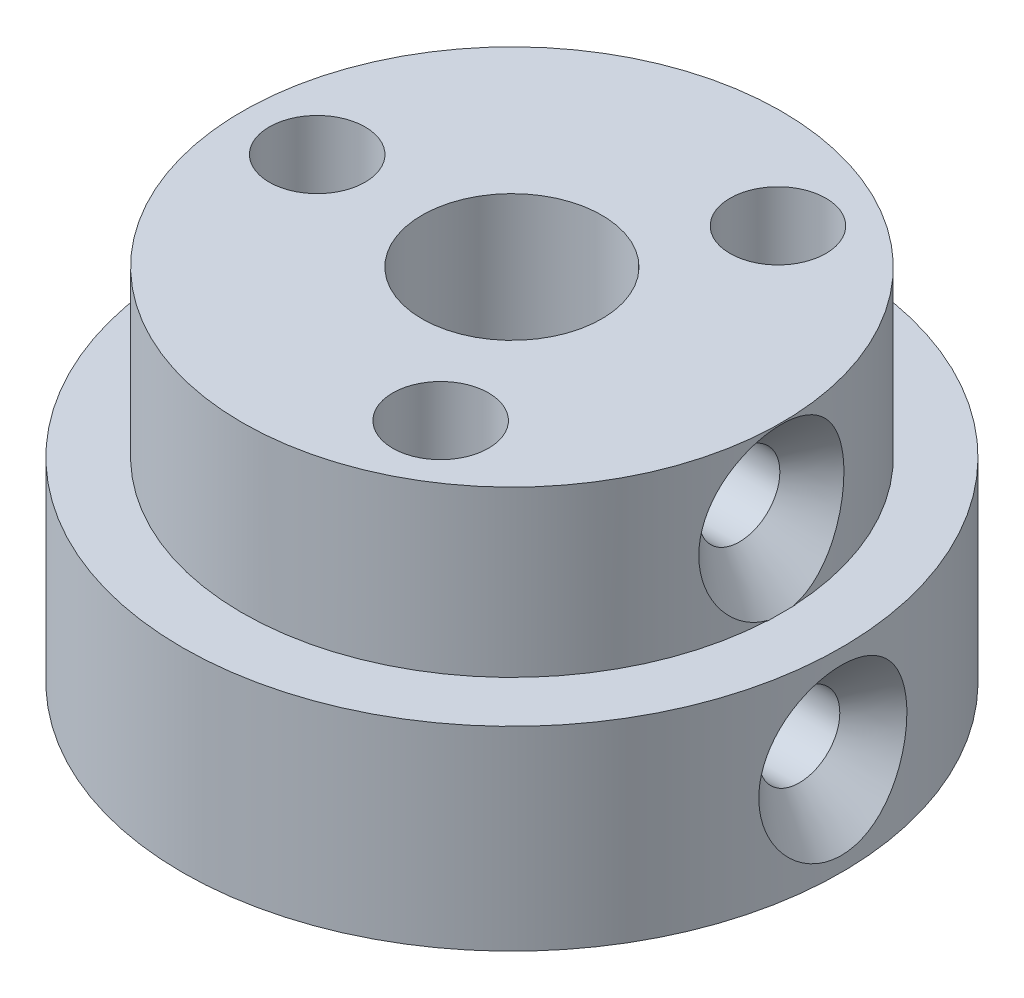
ISO-10303-21;
HEADER;
FILE_DESCRIPTION(('STEP AP214'),'2;1');
FILE_NAME('part.step','',(''),(''),'','','');
FILE_SCHEMA(('AUTOMOTIVE_DESIGN { 1 0 10303 214 1 1 1 1 }'));
ENDSEC;
DATA;
#1=APPLICATION_CONTEXT('core data for automotive mechanical design processes');
#2=APPLICATION_PROTOCOL_DEFINITION('international standard','automotive_design',2000,#1);
#3=PRODUCT_CONTEXT('',#1,'mechanical');
#4=PRODUCT('Part','Part','',(#3));
#5=PRODUCT_RELATED_PRODUCT_CATEGORY('part','',(#4));
#6=PRODUCT_DEFINITION_FORMATION('','',#4);
#7=PRODUCT_DEFINITION_CONTEXT('part definition',#1,'design');
#8=PRODUCT_DEFINITION('design','',#6,#7);
#9=PRODUCT_DEFINITION_SHAPE('','',#8);
#10=(LENGTH_UNIT() NAMED_UNIT(*) SI_UNIT(.MILLI.,.METRE.));
#11=(NAMED_UNIT(*) PLANE_ANGLE_UNIT() SI_UNIT($,.RADIAN.));
#12=(NAMED_UNIT(*) SI_UNIT($,.STERADIAN.) SOLID_ANGLE_UNIT());
#13=UNCERTAINTY_MEASURE_WITH_UNIT(LENGTH_MEASURE(1.E-05),#10,'distance_accuracy_value','');
#14=(GEOMETRIC_REPRESENTATION_CONTEXT(3) GLOBAL_UNCERTAINTY_ASSIGNED_CONTEXT((#13)) GLOBAL_UNIT_ASSIGNED_CONTEXT((#10,
#11,#12)) REPRESENTATION_CONTEXT('',''));
#15=CARTESIAN_POINT('',(0.,0.,0.));
#16=DIRECTION('',(0.,0.,1.));
#17=DIRECTION('',(1.,0.,0.));
#18=AXIS2_PLACEMENT_3D('',#15,#16,#17);
#19=CARTESIAN_POINT('',(0.,12.,0.));
#20=DIRECTION('',(0.,-1.,0.));
#21=DIRECTION('',(0.,0.,-1.));
#22=AXIS2_PLACEMENT_3D('',#19,#20,#21);
#23=CYLINDRICAL_SURFACE('',#22,3.);
#24=CARTESIAN_POINT('',(2.68065100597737,9.20677806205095,-1.34688907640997));
#25=CARTESIAN_POINT('',(2.68065505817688,9.13540011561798,-1.34688542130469));
#26=CARTESIAN_POINT('',(2.68353859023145,9.06390886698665,-1.34118852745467));
#27=CARTESIAN_POINT('',(2.6946800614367,8.92303948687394,-1.31865434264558));
#28=CARTESIAN_POINT('',(2.70295141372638,8.85366708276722,-1.30178924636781));
#29=CARTESIAN_POINT('',(2.72372535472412,8.71932839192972,-1.25773792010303));
#30=CARTESIAN_POINT('',(2.73620871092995,8.6543436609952,-1.23059853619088));
#31=CARTESIAN_POINT('',(2.76396830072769,8.52986363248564,-1.16691118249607));
#32=CARTESIAN_POINT('',(2.77924419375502,8.47036766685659,-1.13036435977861));
#33=CARTESIAN_POINT('',(2.81210632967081,8.35418719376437,-1.04605637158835));
#34=CARTESIAN_POINT('',(2.82977856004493,8.29794909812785,-0.997713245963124));
#35=CARTESIAN_POINT('',(2.86473223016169,8.19403861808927,-0.892404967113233));
#36=CARTESIAN_POINT('',(2.88201350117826,8.14636987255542,-0.83543616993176));
#37=CARTESIAN_POINT('',(2.91531204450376,8.05853658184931,-0.710858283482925));
#38=CARTESIAN_POINT('',(2.93121660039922,8.01889220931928,-0.642849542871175));
#39=CARTESIAN_POINT('',(2.95888121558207,7.95180187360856,-0.500281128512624));
#40=CARTESIAN_POINT('',(2.97064340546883,7.92434963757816,-0.425724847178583));
#41=CARTESIAN_POINT('',(2.98807813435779,7.88409682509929,-0.276883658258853));
#42=CARTESIAN_POINT('',(2.99407141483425,7.8705215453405,-0.202846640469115));
#43=CARTESIAN_POINT('',(3.00045765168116,7.85588642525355,-0.0533198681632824));
#44=CARTESIAN_POINT('',(3.00085328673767,7.85482059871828,0.0221691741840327));
#45=CARTESIAN_POINT('',(2.99617389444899,7.86486883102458,0.16675317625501));
#46=CARTESIAN_POINT('',(2.99148405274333,7.8751262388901,0.235922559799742));
#47=CARTESIAN_POINT('',(2.97769703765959,7.90603697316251,0.371429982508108));
#48=CARTESIAN_POINT('',(2.96859953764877,7.92669107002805,0.437767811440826));
#49=CARTESIAN_POINT('',(2.946679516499,7.97802489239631,0.566958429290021));
#50=CARTESIAN_POINT('',(2.93380251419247,8.00885213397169,0.629742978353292));
#51=CARTESIAN_POINT('',(2.90554153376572,8.0794958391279,0.74940933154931));
#52=CARTESIAN_POINT('',(2.8901566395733,8.11931558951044,0.806288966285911));
#53=CARTESIAN_POINT('',(2.85692586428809,8.21051156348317,0.917388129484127));
#54=CARTESIAN_POINT('',(2.83898156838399,8.26255855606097,0.971028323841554));
#55=CARTESIAN_POINT('',(2.80352640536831,8.37488244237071,1.06909514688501));
#56=CARTESIAN_POINT('',(2.78601576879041,8.43516360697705,1.11351696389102));
#57=CARTESIAN_POINT('',(2.75262745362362,8.56551946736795,1.19374007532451));
#58=CARTESIAN_POINT('',(2.73685422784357,8.63590652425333,1.22908119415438));
#59=CARTESIAN_POINT('',(2.71002386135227,8.78252649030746,1.28716980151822));
#60=CARTESIAN_POINT('',(2.69896270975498,8.85875436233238,1.30992800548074));
#61=CARTESIAN_POINT('',(2.6838518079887,9.00907430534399,1.34060194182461));
#62=CARTESIAN_POINT('',(2.67935574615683,9.08292689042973,1.34946586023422));
#63=CARTESIAN_POINT('',(2.67660252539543,9.23118564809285,1.35492149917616));
#64=CARTESIAN_POINT('',(2.67834253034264,9.30559155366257,1.35151879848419));
#65=CARTESIAN_POINT('',(2.68739898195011,9.44653816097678,1.33340585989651));
#66=CARTESIAN_POINT('',(2.69425769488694,9.51323154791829,1.31962297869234));
#67=CARTESIAN_POINT('',(2.71215967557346,9.64327785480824,1.28242452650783));
#68=CARTESIAN_POINT('',(2.72320403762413,9.70662989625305,1.25900643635));
#69=CARTESIAN_POINT('',(2.74883534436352,9.83140696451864,1.20204750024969));
#70=CARTESIAN_POINT('',(2.76355964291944,9.89261608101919,1.16809760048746));
#71=CARTESIAN_POINT('',(2.79472864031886,10.0087882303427,1.09142256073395));
#72=CARTESIAN_POINT('',(2.81117415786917,10.0637482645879,1.04869323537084));
#73=CARTESIAN_POINT('',(2.84587623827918,10.1714733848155,0.950757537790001));
#74=CARTESIAN_POINT('',(2.86415252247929,10.2234971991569,0.894739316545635));
#75=CARTESIAN_POINT('',(2.89900875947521,10.3175739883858,0.774383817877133));
#76=CARTESIAN_POINT('',(2.91558844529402,10.3596253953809,0.710045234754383));
#77=CARTESIAN_POINT('',(2.94544111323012,10.4328157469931,0.573828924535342));
#78=CARTESIAN_POINT('',(2.95867951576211,10.4638418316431,0.501882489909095));
#79=CARTESIAN_POINT('',(2.98010169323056,10.5130838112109,0.353031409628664));
#80=CARTESIAN_POINT('',(2.98828903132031,10.5313087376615,0.276130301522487));
#81=CARTESIAN_POINT('',(2.99821529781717,10.5531606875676,0.126117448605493));
#82=CARTESIAN_POINT('',(3.00041288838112,10.557827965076,0.0531868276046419));
#83=CARTESIAN_POINT('',(2.99945879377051,10.5553327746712,-0.0924271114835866));
#84=CARTESIAN_POINT('',(2.99630834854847,10.548173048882,-0.165110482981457));
#85=CARTESIAN_POINT('',(2.98527352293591,10.5229666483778,-0.304664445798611));
#86=CARTESIAN_POINT('',(2.97761507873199,10.5054393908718,-0.371648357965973));
#87=CARTESIAN_POINT('',(2.95848714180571,10.460611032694,-0.501673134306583));
#88=CARTESIAN_POINT('',(2.94701699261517,10.4333082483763,-0.564713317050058));
#89=CARTESIAN_POINT('',(2.92069666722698,10.3683332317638,-0.688260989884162));
#90=CARTESIAN_POINT('',(2.90571574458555,10.330243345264,-0.748520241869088));
#91=CARTESIAN_POINT('',(2.87407962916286,10.2453444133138,-0.862058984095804));
#92=CARTESIAN_POINT('',(2.85742371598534,10.1985316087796,-0.915335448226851));
#93=CARTESIAN_POINT('',(2.82259407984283,10.093077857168,-1.01790422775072));
#94=CARTESIAN_POINT('',(2.80440660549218,10.0337862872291,-1.06652522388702));
#95=CARTESIAN_POINT('',(2.76986078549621,9.90741295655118,-1.15328176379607));
#96=CARTESIAN_POINT('',(2.7535036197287,9.84032622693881,-1.1914105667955));
#97=CARTESIAN_POINT('',(2.72460083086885,9.69949242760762,-1.2561130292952));
#98=CARTESIAN_POINT('',(2.71207886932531,9.62570751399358,-1.28261537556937));
#99=CARTESIAN_POINT('',(2.692884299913,9.47407510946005,-1.32245142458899));
#100=CARTESIAN_POINT('',(2.68619206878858,9.39624218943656,-1.33582932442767));
#101=CARTESIAN_POINT('',(2.68218265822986,9.29938067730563,-1.34383611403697));
#102=CARTESIAN_POINT('',(2.6816095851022,9.28088573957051,-1.34497979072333));
#103=CARTESIAN_POINT('',(2.68084322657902,9.24385577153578,-1.34650675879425));
#104=CARTESIAN_POINT('',(2.68064995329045,9.22532073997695,-1.34689002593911));
#105=CARTESIAN_POINT('',(2.68065100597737,9.20677806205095,-1.34688907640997));
#106=B_SPLINE_CURVE_WITH_KNOTS('',3,(#24,#25,#26,#27,#28,#29,#30,#31,#32,#33,#34,#35,#36,#37,
#38,#39,#40,#41,#42,#43,#44,#45,#46,#47,#48,#49,#50,#51,#52,#53,#54,#55,#56,#57,#58,#59,#60,#61,
#62,#63,#64,#65,#66,#67,#68,#69,#70,#71,#72,#73,#74,#75,#76,#77,#78,#79,#80,#81,#82,#83,#84,#85,
#86,#87,#88,#89,#90,#91,#92,#93,#94,#95,#96,#97,#98,#99,#100,#101,#102,#103,#104,#105),
.UNSPECIFIED.,.T.,.F.,(4,2,2,2,2,2,2,2,2,2,2,2,2,2,2,2,2,2,2,2,2,2,2,2,2,2,2,2,2,2,2,2,2,2,2,2,
2,2,2,2,4),(0.,0.214055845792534,0.428646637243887,0.642270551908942,0.855868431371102,
1.08359761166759,1.31142326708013,1.55111519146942,1.7906836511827,2.01599531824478,
2.24119916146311,2.45046498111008,2.65974631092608,2.87220645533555,3.08474438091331,
3.31433040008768,3.54403595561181,3.78375440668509,4.02326840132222,4.24558900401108,
4.46780850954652,4.67223214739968,4.87670926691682,5.09041213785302,5.30421712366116,
5.53894745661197,5.77371467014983,6.01082017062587,6.24775821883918,6.46596276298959,
6.68411672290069,6.8921700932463,7.10025931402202,7.3178791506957,7.53559298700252,
7.77092535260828,8.00640855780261,8.24331661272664,8.47942410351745,8.53503010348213,
8.59063787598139),.UNSPECIFIED.);
#107=CARTESIAN_POINT('',(2.68065100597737,9.20677806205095,-1.34688907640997));
#108=VERTEX_POINT('',#107);
#109=EDGE_CURVE('E112',#108,#108,#106,.T.);
#110=ORIENTED_EDGE('',*,*,#109,.F.);
#111=EDGE_LOOP('',(#110));
#112=FACE_BOUND('',#111,.T.);
#113=CARTESIAN_POINT('',(2.68016418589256,3.24291067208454,-1.34785753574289));
#114=CARTESIAN_POINT('',(2.68016823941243,3.17153272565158,-1.34785388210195));
#115=CARTESIAN_POINT('',(2.68305382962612,3.10004147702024,-1.34215803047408));
#116=CARTESIAN_POINT('',(2.69420344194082,2.95917209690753,-1.31962787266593));
#117=CARTESIAN_POINT('',(2.70248088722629,2.88979969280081,-1.30276576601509));
#118=CARTESIAN_POINT('',(2.72327074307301,2.75546100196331,-1.25872194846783));
#119=CARTESIAN_POINT('',(2.73576390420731,2.69047627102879,-1.23158707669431));
#120=CARTESIAN_POINT('',(2.76354650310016,2.56599624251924,-1.16790975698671));
#121=CARTESIAN_POINT('',(2.77883559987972,2.50650027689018,-1.13136845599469));
#122=CARTESIAN_POINT('',(2.8117281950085,2.39031980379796,-1.04707234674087));
#123=CARTESIAN_POINT('',(2.82941789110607,2.33408170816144,-0.998735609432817));
#124=CARTESIAN_POINT('',(2.86440960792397,2.23017122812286,-0.8934399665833));
#125=CARTESIAN_POINT('',(2.88171146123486,2.18250248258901,-0.836477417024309));
#126=CARTESIAN_POINT('',(2.91505501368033,2.0946691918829,-0.711911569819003));
#127=CARTESIAN_POINT('',(2.930984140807,2.05502481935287,-0.643908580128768));
#128=CARTESIAN_POINT('',(2.95870026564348,1.98793448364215,-0.501350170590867));
#129=CARTESIAN_POINT('',(2.97048939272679,1.96048224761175,-0.426798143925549));
#130=CARTESIAN_POINT('',(2.98797789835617,1.92022943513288,-0.277963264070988));
#131=CARTESIAN_POINT('',(2.99399792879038,1.90665415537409,-0.203928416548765));
#132=CARTESIAN_POINT('',(3.00043819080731,1.89201903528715,-0.0544039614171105));
#133=CARTESIAN_POINT('',(3.00086110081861,1.89095320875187,0.0210849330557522));
#134=CARTESIAN_POINT('',(2.99623394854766,1.90100144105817,0.165670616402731));
#135=CARTESIAN_POINT('',(2.99156909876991,1.91125884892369,0.234841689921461));
#136=CARTESIAN_POINT('',(2.9778310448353,1.9421695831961,0.370354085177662));
#137=CARTESIAN_POINT('',(2.96875751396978,1.96282368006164,0.436695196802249));
#138=CARTESIAN_POINT('',(2.94688417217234,2.0141575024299,0.565893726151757));
#139=CARTESIAN_POINT('',(2.93402985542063,2.04498474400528,0.628682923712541));
#140=CARTESIAN_POINT('',(2.90581211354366,2.11562844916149,0.748359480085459));
#141=CARTESIAN_POINT('',(2.89044777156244,2.15544819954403,0.805244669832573));
#142=CARTESIAN_POINT('',(2.85725713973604,2.24664417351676,0.916355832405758));
#143=CARTESIAN_POINT('',(2.83933222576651,2.29869116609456,0.970002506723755));
#144=CARTESIAN_POINT('',(2.80391249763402,2.4110150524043,1.06808213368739));
#145=CARTESIAN_POINT('',(2.78641791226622,2.47129621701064,1.11251027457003));
#146=CARTESIAN_POINT('',(2.75305858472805,2.60165207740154,1.19274544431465));
#147=CARTESIAN_POINT('',(2.73729812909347,2.67203913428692,1.22809225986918));
#148=CARTESIAN_POINT('',(2.7104887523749,2.81865910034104,1.28619055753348));
#149=CARTESIAN_POINT('',(2.69943582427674,2.89488697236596,1.30895275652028));
#150=CARTESIAN_POINT('',(2.68433600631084,3.04520691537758,1.33963215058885));
#151=CARTESIAN_POINT('',(2.67984314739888,3.11905950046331,1.34849769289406));
#152=CARTESIAN_POINT('',(2.6770918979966,3.26731825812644,1.35395432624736));
#153=CARTESIAN_POINT('',(2.67883067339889,3.34172416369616,1.3505509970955));
#154=CARTESIAN_POINT('',(2.68788058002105,3.48267077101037,1.3324347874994));
#155=CARTESIAN_POINT('',(2.69473431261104,3.54936415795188,1.31864942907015));
#156=CARTESIAN_POINT('',(2.71262285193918,3.67941046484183,1.28144451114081));
#157=CARTESIAN_POINT('',(2.72365875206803,3.74276250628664,1.25802243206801));
#158=CARTESIAN_POINT('',(2.749269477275,3.86753957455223,1.20105423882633));
#159=CARTESIAN_POINT('',(2.76398150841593,3.92874869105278,1.16709902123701));
#160=CARTESIAN_POINT('',(2.79512280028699,4.04492084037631,1.09041272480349));
#161=CARTESIAN_POINT('',(2.81155287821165,4.09988087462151,1.04767746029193));
#162=CARTESIAN_POINT('',(2.84621957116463,4.20760599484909,0.949729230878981));
#163=CARTESIAN_POINT('',(2.86447561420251,4.25962980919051,0.893704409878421));
#164=CARTESIAN_POINT('',(2.8992883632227,4.35370659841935,0.773336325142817));
#165=CARTESIAN_POINT('',(2.91584480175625,4.39575800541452,0.708991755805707));
#166=CARTESIAN_POINT('',(2.94564825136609,4.46894835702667,0.572764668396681));
#167=CARTESIAN_POINT('',(2.95886065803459,4.49997444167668,0.500813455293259));
#168=CARTESIAN_POINT('',(2.98022905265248,4.5492164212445,0.351954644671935));
#169=CARTESIAN_POINT('',(2.98838860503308,4.56744134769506,0.275050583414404));
#170=CARTESIAN_POINT('',(2.99826066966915,4.58929329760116,0.125034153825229));
#171=CARTESIAN_POINT('',(3.00043190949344,4.59396057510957,0.0521027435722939));
#172=CARTESIAN_POINT('',(2.9994252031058,4.59146538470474,-0.0935108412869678));
#173=CARTESIAN_POINT('',(2.99624849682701,4.58430565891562,-0.166193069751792));
#174=CARTESIAN_POINT('',(2.98516324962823,4.55909925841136,-0.305743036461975));
#175=CARTESIAN_POINT('',(2.97748060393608,4.5415720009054,-0.372724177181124));
#176=CARTESIAN_POINT('',(2.95830568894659,4.49674364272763,-0.502742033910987));
#177=CARTESIAN_POINT('',(2.94681276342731,4.46944085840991,-0.565778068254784));
#178=CARTESIAN_POINT('',(2.92044780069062,4.40446584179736,-0.689316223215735));
#179=CARTESIAN_POINT('',(2.90544510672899,4.3663759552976,-0.749570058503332));
#180=CARTESIAN_POINT('',(2.87376797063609,4.2814770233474,-0.863097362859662));
#181=CARTESIAN_POINT('',(2.85709280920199,4.23466421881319,-0.916367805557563));
#182=CARTESIAN_POINT('',(2.82222611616,4.12921046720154,-1.01892399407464));
#183=CARTESIAN_POINT('',(2.80402107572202,4.0699188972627,-1.0675384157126));
#184=CARTESIAN_POINT('',(2.76944391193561,3.94354556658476,-1.15428246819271));
#185=CARTESIAN_POINT('',(2.75307297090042,3.8764588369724,-1.19240535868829));
#186=CARTESIAN_POINT('',(2.72414680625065,3.73562503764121,-1.25709737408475));
#187=CARTESIAN_POINT('',(2.71161526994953,3.66184012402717,-1.28359519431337));
#188=CARTESIAN_POINT('',(2.6924063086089,3.51020771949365,-1.32342430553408));
#189=CARTESIAN_POINT('',(2.68570924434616,3.43237479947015,-1.33679978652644));
#190=CARTESIAN_POINT('',(2.68169694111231,3.33551328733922,-1.34480512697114));
#191=CARTESIAN_POINT('',(2.6811234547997,3.3170183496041,-1.34594859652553));
#192=CARTESIAN_POINT('',(2.68035654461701,3.27998838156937,-1.34747528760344));
#193=CARTESIAN_POINT('',(2.68016313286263,3.26145335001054,-1.34785848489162));
#194=CARTESIAN_POINT('',(2.68016418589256,3.24291067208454,-1.34785753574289));
#195=B_SPLINE_CURVE_WITH_KNOTS('',3,(#113,#114,#115,#116,#117,#118,#119,#120,#121,#122,#123,
#124,#125,#126,#127,#128,#129,#130,#131,#132,#133,#134,#135,#136,#137,#138,#139,#140,#141,#142,
#143,#144,#145,#146,#147,#148,#149,#150,#151,#152,#153,#154,#155,#156,#157,#158,#159,#160,#161,
#162,#163,#164,#165,#166,#167,#168,#169,#170,#171,#172,#173,#174,#175,#176,#177,#178,#179,#180,
#181,#182,#183,#184,#185,#186,#187,#188,#189,#190,#191,#192,#193,#194),.UNSPECIFIED.,.T.,.F.,(4,
2,2,2,2,2,2,2,2,2,2,2,2,2,2,2,2,2,2,2,2,2,2,2,2,2,2,2,2,2,2,2,2,2,2,2,2,2,2,2,4),(0.,
0.214055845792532,0.428646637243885,0.642270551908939,0.855868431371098,1.08359761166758,
1.31142326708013,1.55111519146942,1.7906836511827,2.01599531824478,2.2411991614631,
2.45046498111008,2.65974631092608,2.87220645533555,3.08474438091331,3.31433040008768,
3.5440359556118,3.78375440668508,4.02326840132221,4.24558900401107,4.46780850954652,
4.67223214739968,4.87670926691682,5.09041213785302,5.30421712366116,5.53894745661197,
5.77371467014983,6.01082017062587,6.24775821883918,6.46596276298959,6.68411672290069,
6.8921700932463,7.10025931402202,7.3178791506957,7.53559298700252,7.77092535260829,
8.00640855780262,8.24331661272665,8.47942410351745,8.53503010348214,8.5906378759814),.UNSPECIFIED.);
#196=CARTESIAN_POINT('',(2.68016418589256,3.24291067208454,-1.34785753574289));
#197=VERTEX_POINT('',#196);
#198=EDGE_CURVE('E175',#197,#197,#195,.T.);
#199=ORIENTED_EDGE('',*,*,#198,.F.);
#200=EDGE_LOOP('',(#199));
#201=FACE_BOUND('',#200,.T.);
#202=CARTESIAN_POINT('',(0.,12.,0.));
#203=DIRECTION('',(0.,1.,0.));
#204=DIRECTION('',(0.,0.,1.));
#205=AXIS2_PLACEMENT_3D('',#202,#203,#204);
#206=CIRCLE('',#205,3.);
#207=CARTESIAN_POINT('',(0.,12.,3.));
#208=VERTEX_POINT('',#207);
#209=EDGE_CURVE('E179',#208,#208,#206,.T.);
#210=ORIENTED_EDGE('',*,*,#209,.T.);
#211=EDGE_LOOP('',(#210));
#212=FACE_BOUND('',#211,.T.);
#213=CARTESIAN_POINT('',(0.,0.,0.));
#214=DIRECTION('',(0.,1.,0.));
#215=DIRECTION('',(0.,0.,1.));
#216=AXIS2_PLACEMENT_3D('',#213,#214,#215);
#217=CIRCLE('',#216,3.);
#218=CARTESIAN_POINT('',(0.,0.,3.));
#219=VERTEX_POINT('',#218);
#220=EDGE_CURVE('E182',#219,#219,#217,.T.);
#221=ORIENTED_EDGE('',*,*,#220,.F.);
#222=EDGE_LOOP('',(#221));
#223=FACE_BOUND('',#222,.T.);
#224=ADVANCED_FACE('F38',(#112,#201,#212,#223),#23,.F.);
#225=CARTESIAN_POINT('',(0.,12.,0.));
#226=DIRECTION('',(0.,-1.,0.));
#227=DIRECTION('',(0.,0.,-1.));
#228=AXIS2_PLACEMENT_3D('',#225,#226,#227);
#229=CYLINDRICAL_SURFACE('',#228,9.);
#230=CARTESIAN_POINT('',(0.,6.5,0.));
#231=DIRECTION('',(0.,1.,0.));
#232=DIRECTION('',(0.,0.,1.));
#233=AXIS2_PLACEMENT_3D('',#230,#231,#232);
#234=CIRCLE('',#233,9.);
#235=CARTESIAN_POINT('',(8.99044255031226,6.5,-0.414659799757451));
#236=VERTEX_POINT('',#235);
#237=CARTESIAN_POINT('',(8.98945560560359,6.5,0.435531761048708));
#238=VERTEX_POINT('',#237);
#239=EDGE_CURVE('E189',#236,#238,#234,.T.);
#240=ORIENTED_EDGE('',*,*,#239,.T.);
#241=CARTESIAN_POINT('',(8.81845303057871,7.38623172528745,-1.79857899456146));
#242=CARTESIAN_POINT('',(8.83426355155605,7.28680325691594,-1.72105270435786));
#243=CARTESIAN_POINT('',(8.85042986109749,7.19287396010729,-1.63658913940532));
#244=CARTESIAN_POINT('',(8.88215373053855,7.0184075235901,-1.45460467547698));
#245=CARTESIAN_POINT('',(8.89771120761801,6.93787220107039,-1.35708200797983));
#246=CARTESIAN_POINT('',(8.92896946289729,6.78210420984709,-1.13484283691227));
#247=CARTESIAN_POINT('',(8.94434508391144,6.70945688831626,-1.00824002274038));
#248=CARTESIAN_POINT('',(8.9702675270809,6.589808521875,-0.742946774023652));
#249=CARTESIAN_POINT('',(8.98081806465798,6.54278773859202,-0.604265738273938));
#250=CARTESIAN_POINT('',(8.99447585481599,6.48206264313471,-0.338682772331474));
#251=CARTESIAN_POINT('',(8.99838049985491,6.46478562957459,-0.212635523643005));
#252=CARTESIAN_POINT('',(9.00079668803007,6.45319319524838,0.0405291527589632));
#253=CARTESIAN_POINT('',(8.99931145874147,6.45886403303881,0.167645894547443));
#254=CARTESIAN_POINT('',(8.9914844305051,6.49132350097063,0.407999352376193));
#255=CARTESIAN_POINT('',(8.98556258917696,6.51629162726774,0.521502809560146));
#256=CARTESIAN_POINT('',(8.96997767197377,6.58383763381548,0.742844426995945));
#257=CARTESIAN_POINT('',(8.96031416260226,6.62641755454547,0.85068192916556));
#258=CARTESIAN_POINT('',(8.937738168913,6.7292569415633,1.0623628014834));
#259=CARTESIAN_POINT('',(8.92471485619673,6.79013433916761,1.16589222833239));
#260=CARTESIAN_POINT('',(8.89681944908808,6.92649419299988,1.36252922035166));
#261=CARTESIAN_POINT('',(8.8819466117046,7.00198252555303,1.45563256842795));
#262=CARTESIAN_POINT('',(8.84972408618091,7.17516329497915,1.6408125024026));
#263=CARTESIAN_POINT('',(8.83229286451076,7.2744386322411,1.731393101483));
#264=CARTESIAN_POINT('',(8.79824430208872,7.48542359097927,1.89685154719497));
#265=CARTESIAN_POINT('',(8.78162739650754,7.59713975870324,1.97172106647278));
#266=CARTESIAN_POINT('',(8.74862117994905,7.8454356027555,2.11367593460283));
#267=CARTESIAN_POINT('',(8.73254167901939,7.98336008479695,2.17848765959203));
#268=CARTESIAN_POINT('',(8.70492974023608,8.26790583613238,2.28632930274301));
#269=CARTESIAN_POINT('',(8.69339889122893,8.41453012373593,2.32935161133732));
#270=CARTESIAN_POINT('',(8.67542867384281,8.7241737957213,2.39545941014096));
#271=CARTESIAN_POINT('',(8.66943897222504,8.88759560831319,2.416796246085));
#272=CARTESIAN_POINT('',(8.6648289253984,9.21586162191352,2.4332714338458));
#273=CARTESIAN_POINT('',(8.6662095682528,9.380706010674,2.42840627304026));
#274=CARTESIAN_POINT('',(8.67626929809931,9.71036218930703,2.39221888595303));
#275=CARTESIAN_POINT('',(8.6850835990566,9.87511639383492,2.36040645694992));
#276=CARTESIAN_POINT('',(8.70910298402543,10.196734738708,2.27017375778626));
#277=CARTESIAN_POINT('',(8.7243093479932,10.3535972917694,2.21174815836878));
#278=CARTESIAN_POINT('',(8.75910439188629,10.6536070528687,2.06963531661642));
#279=CARTESIAN_POINT('',(8.77866208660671,10.7968414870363,1.98612529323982));
#280=CARTESIAN_POINT('',(8.81975429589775,11.0658953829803,1.79484559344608));
#281=CARTESIAN_POINT('',(8.84128865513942,11.191716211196,1.68707782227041));
#282=CARTESIAN_POINT('',(8.88213446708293,11.4136002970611,1.45622090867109));
#283=CARTESIAN_POINT('',(8.9015019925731,11.510986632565,1.33442099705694));
#284=CARTESIAN_POINT('',(8.9366794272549,11.6802190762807,1.07374925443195));
#285=CARTESIAN_POINT('',(8.95249433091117,11.7521011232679,0.934901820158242));
#286=CARTESIAN_POINT('',(8.97630905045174,11.8576199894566,0.664598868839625));
#287=CARTESIAN_POINT('',(8.98508195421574,11.8951432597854,0.534730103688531));
#288=CARTESIAN_POINT('',(8.99691960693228,11.9450134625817,0.270018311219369));
#289=CARTESIAN_POINT('',(8.99998990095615,11.9573848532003,0.135180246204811));
#290=CARTESIAN_POINT('',(9.00000883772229,11.9562012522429,-0.117734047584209));
#291=CARTESIAN_POINT('',(8.99766287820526,11.9456432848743,-0.235835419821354));
#292=CARTESIAN_POINT('',(8.98855277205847,11.9051516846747,-0.468470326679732));
#293=CARTESIAN_POINT('',(8.98178883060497,11.875218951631,-0.583004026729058));
#294=CARTESIAN_POINT('',(8.96464379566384,11.7978188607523,-0.804640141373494));
#295=CARTESIAN_POINT('',(8.95429086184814,11.7504878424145,-0.91179284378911));
#296=CARTESIAN_POINT('',(8.93095912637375,11.6403065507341,-1.11745156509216));
#297=CARTESIAN_POINT('',(8.91797955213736,11.5774517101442,-1.21595502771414));
#298=CARTESIAN_POINT('',(8.88915559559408,11.4315613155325,-1.4119768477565));
#299=CARTESIAN_POINT('',(8.87315499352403,11.347148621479,-1.50844462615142));
#300=CARTESIAN_POINT('',(8.84079609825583,11.1650278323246,-1.68779327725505));
#301=CARTESIAN_POINT('',(8.82443762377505,11.0673128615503,-1.77066707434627));
#302=CARTESIAN_POINT('',(8.79057386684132,10.8471343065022,-1.93223500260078));
#303=CARTESIAN_POINT('',(8.77321396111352,10.7231115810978,-2.00883777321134));
#304=CARTESIAN_POINT('',(8.74152358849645,10.4646100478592,-2.14254375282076));
#305=CARTESIAN_POINT('',(8.72719448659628,10.3301265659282,-2.19963818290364));
#306=CARTESIAN_POINT('',(8.70173662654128,10.0400145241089,-2.29840464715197));
#307=CARTESIAN_POINT('',(8.69107334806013,9.88361834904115,-2.33795396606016));
#308=CARTESIAN_POINT('',(8.6763366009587,9.5662642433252,-2.39206418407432));
#309=CARTESIAN_POINT('',(8.67226411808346,9.40530563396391,-2.40662134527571));
#310=CARTESIAN_POINT('',(8.6711647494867,9.0772707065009,-2.41058490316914));
#311=CARTESIAN_POINT('',(8.67439512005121,8.91018152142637,-2.39907294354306));
#312=CARTESIAN_POINT('',(8.68804234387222,8.58029966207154,-2.34916518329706));
#313=CARTESIAN_POINT('',(8.69846195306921,8.41750866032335,-2.31075907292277));
#314=CARTESIAN_POINT('',(8.72514639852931,8.1015458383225,-2.20785488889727));
#315=CARTESIAN_POINT('',(8.7413899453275,7.94834133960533,-2.1434517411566));
#316=CARTESIAN_POINT('',(8.77770652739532,7.65570940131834,-1.98949622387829));
#317=CARTESIAN_POINT('',(8.79777550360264,7.51626759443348,-1.89997046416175));
#318=CARTESIAN_POINT('',(8.81845303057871,7.38623172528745,-1.79857899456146));
#319=B_SPLINE_CURVE_WITH_KNOTS('',3,(#241,#242,#243,#244,#245,#246,#247,#248,#249,#250,#251,
#252,#253,#254,#255,#256,#257,#258,#259,#260,#261,#262,#263,#264,#265,#266,#267,#268,#269,#270,
#271,#272,#273,#274,#275,#276,#277,#278,#279,#280,#281,#282,#283,#284,#285,#286,#287,#288,#289,
#290,#291,#292,#293,#294,#295,#296,#297,#298,#299,#300,#301,#302,#303,#304,#305,#306,#307,#308,
#309,#310,#311,#312,#313,#314,#315,#316,#317,#318),.UNSPECIFIED.,.T.,.F.,(4,2,2,2,2,2,2,2,2,2,2,
2,2,2,2,2,2,2,2,2,2,2,2,2,2,2,2,2,2,2,2,2,2,2,2,2,2,2,4),(0.,0.380806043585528,
0.761663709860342,1.19936381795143,1.63672631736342,2.01647788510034,2.3960020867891,
2.74353284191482,3.09110387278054,3.45206563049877,3.81317286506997,4.21810605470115,
4.62325333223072,5.08101601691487,5.53893845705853,6.03140262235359,6.52393280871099,
7.02562001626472,7.52740773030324,8.02573056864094,8.52401428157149,8.99271947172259,
9.46076154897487,9.86478247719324,10.2684103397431,10.6224758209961,10.9765248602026,
11.3278566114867,11.6792918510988,12.065306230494,12.4515208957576,12.8901173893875,
13.3289109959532,13.811739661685,14.2946405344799,14.794816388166,15.2951840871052,
15.7937410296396,16.2917718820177),.UNSPECIFIED.);
#320=EDGE_CURVE('E54',#238,#236,#319,.T.);
#321=ORIENTED_EDGE('',*,*,#320,.T.);
#322=EDGE_LOOP('',(#240,#321));
#323=FACE_BOUND('',#322,.T.);
#324=CARTESIAN_POINT('',(0.,12.,0.));
#325=DIRECTION('',(0.,1.,0.));
#326=DIRECTION('',(0.,0.,1.));
#327=AXIS2_PLACEMENT_3D('',#324,#325,#326);
#328=CIRCLE('',#327,9.);
#329=CARTESIAN_POINT('',(0.,12.,9.));
#330=VERTEX_POINT('',#329);
#331=EDGE_CURVE('E186',#330,#330,#328,.T.);
#332=ORIENTED_EDGE('',*,*,#331,.F.);
#333=EDGE_LOOP('',(#332));
#334=FACE_BOUND('',#333,.T.);
#335=ADVANCED_FACE('F164',(#323,#334),#229,.T.);
#336=CARTESIAN_POINT('',(0.,12.,0.));
#337=DIRECTION('',(0.,1.,0.));
#338=DIRECTION('',(0.,0.,1.));
#339=AXIS2_PLACEMENT_3D('',#336,#337,#338);
#340=PLANE('',#339);
#341=CARTESIAN_POINT('',(3.25000000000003,12.,-5.62916512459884));
#342=DIRECTION('',(0.,1.,0.));
#343=DIRECTION('',(0.,0.,1.));
#344=AXIS2_PLACEMENT_3D('',#341,#342,#343);
#345=CIRCLE('',#344,1.6);
#346=CARTESIAN_POINT('',(3.25000000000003,12.,-4.02916512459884));
#347=VERTEX_POINT('',#346);
#348=EDGE_CURVE('E41',#347,#347,#345,.T.);
#349=ORIENTED_EDGE('',*,*,#348,.F.);
#350=EDGE_LOOP('',(#349));
#351=FACE_BOUND('',#350,.T.);
#352=CARTESIAN_POINT('',(3.25000000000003,12.,5.62916512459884));
#353=DIRECTION('',(0.,1.,0.));
#354=DIRECTION('',(0.,0.,1.));
#355=AXIS2_PLACEMENT_3D('',#352,#353,#354);
#356=CIRCLE('',#355,1.6);
#357=CARTESIAN_POINT('',(3.25000000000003,12.,7.22916512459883));
#358=VERTEX_POINT('',#357);
#359=EDGE_CURVE('E91',#358,#358,#356,.T.);
#360=ORIENTED_EDGE('',*,*,#359,.F.);
#361=EDGE_LOOP('',(#360));
#362=FACE_BOUND('',#361,.T.);
#363=CARTESIAN_POINT('',(-6.5,12.,0.));
#364=DIRECTION('',(0.,1.,0.));
#365=DIRECTION('',(0.,0.,1.));
#366=AXIS2_PLACEMENT_3D('',#363,#364,#365);
#367=CIRCLE('',#366,1.6);
#368=CARTESIAN_POINT('',(-6.5,12.,1.6));
#369=VERTEX_POINT('',#368);
#370=EDGE_CURVE('E76',#369,#369,#367,.T.);
#371=ORIENTED_EDGE('',*,*,#370,.F.);
#372=EDGE_LOOP('',(#371));
#373=FACE_BOUND('',#372,.T.);
#374=ORIENTED_EDGE('',*,*,#209,.F.);
#375=EDGE_LOOP('',(#374));
#376=FACE_BOUND('',#375,.T.);
#377=ORIENTED_EDGE('',*,*,#331,.T.);
#378=EDGE_LOOP('',(#377));
#379=FACE_BOUND('',#378,.T.);
#380=ADVANCED_FACE('F169',(#351,#362,#373,#376,#379),#340,.T.);
#381=CARTESIAN_POINT('',(0.,0.,0.));
#382=DIRECTION('',(0.,1.,0.));
#383=DIRECTION('',(0.,0.,1.));
#384=AXIS2_PLACEMENT_3D('',#381,#382,#383);
#385=PLANE('',#384);
#386=CARTESIAN_POINT('',(3.25000000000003,0.,-5.62916512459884));
#387=DIRECTION('',(0.,-1.,0.));
#388=DIRECTION('',(0.,0.,-1.));
#389=AXIS2_PLACEMENT_3D('',#386,#387,#388);
#390=CIRCLE('',#389,3.15);
#391=CARTESIAN_POINT('',(3.25000000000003,0.,-8.77916512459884));
#392=VERTEX_POINT('',#391);
#393=EDGE_CURVE('E236',#392,#392,#390,.T.);
#394=ORIENTED_EDGE('',*,*,#393,.F.);
#395=EDGE_LOOP('',(#394));
#396=FACE_BOUND('',#395,.T.);
#397=CARTESIAN_POINT('',(3.25000000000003,0.,5.62916512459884));
#398=DIRECTION('',(0.,-1.,0.));
#399=DIRECTION('',(0.,0.,-1.));
#400=AXIS2_PLACEMENT_3D('',#397,#398,#399);
#401=CIRCLE('',#400,3.15);
#402=CARTESIAN_POINT('',(3.25000000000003,0.,2.47916512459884));
#403=VERTEX_POINT('',#402);
#404=EDGE_CURVE('E100',#403,#403,#401,.T.);
#405=ORIENTED_EDGE('',*,*,#404,.F.);
#406=EDGE_LOOP('',(#405));
#407=FACE_BOUND('',#406,.T.);
#408=CARTESIAN_POINT('',(-6.5,0.,0.));
#409=DIRECTION('',(0.,-1.,0.));
#410=DIRECTION('',(0.,0.,-1.));
#411=AXIS2_PLACEMENT_3D('',#408,#409,#410);
#412=CIRCLE('',#411,3.15);
#413=CARTESIAN_POINT('',(-6.5,0.,-3.15));
#414=VERTEX_POINT('',#413);
#415=EDGE_CURVE('E93',#414,#414,#412,.T.);
#416=ORIENTED_EDGE('',*,*,#415,.F.);
#417=EDGE_LOOP('',(#416));
#418=FACE_BOUND('',#417,.T.);
#419=ORIENTED_EDGE('',*,*,#220,.T.);
#420=EDGE_LOOP('',(#419));
#421=FACE_BOUND('',#420,.T.);
#422=CARTESIAN_POINT('',(0.,0.,0.));
#423=DIRECTION('',(0.,1.,0.));
#424=DIRECTION('',(0.,0.,1.));
#425=AXIS2_PLACEMENT_3D('',#422,#423,#424);
#426=CIRCLE('',#425,11.);
#427=CARTESIAN_POINT('',(0.,0.,11.));
#428=VERTEX_POINT('',#427);
#429=EDGE_CURVE('E215',#428,#428,#426,.T.);
#430=ORIENTED_EDGE('',*,*,#429,.F.);
#431=EDGE_LOOP('',(#430));
#432=FACE_BOUND('',#431,.T.);
#433=ADVANCED_FACE('F222',(#396,#407,#418,#421,#432),#385,.F.);
#434=CARTESIAN_POINT('',(0.,6.5,0.));
#435=DIRECTION('',(0.,-1.,0.));
#436=DIRECTION('',(0.,0.,-1.));
#437=AXIS2_PLACEMENT_3D('',#434,#435,#436);
#438=CYLINDRICAL_SURFACE('',#437,11.);
#439=CARTESIAN_POINT('',(10.8496592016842,1.38973389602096,-1.81242809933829));
#440=CARTESIAN_POINT('',(10.8632241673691,1.29082745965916,-1.73121897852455));
#441=CARTESIAN_POINT('',(10.8770335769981,1.19776412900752,-1.64295679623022));
#442=CARTESIAN_POINT('',(10.9039776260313,1.02576083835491,-1.45342027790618));
#443=CARTESIAN_POINT('',(10.9171121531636,0.94682322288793,-1.35214378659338));
#444=CARTESIAN_POINT('',(10.9431136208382,0.796273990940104,-1.12388654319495));
#445=CARTESIAN_POINT('',(10.9557104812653,0.727049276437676,-0.995279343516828));
#446=CARTESIAN_POINT('',(10.9767690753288,0.613896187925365,-0.727027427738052));
#447=CARTESIAN_POINT('',(10.9852328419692,0.569955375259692,-0.587388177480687));
#448=CARTESIAN_POINT('',(10.9961582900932,0.513357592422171,-0.317418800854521));
#449=CARTESIAN_POINT('',(10.9991687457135,0.497838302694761,-0.187708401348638));
#450=CARTESIAN_POINT('',(11.0005290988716,0.489990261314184,0.0724054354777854));
#451=CARTESIAN_POINT('',(10.9988812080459,0.49765050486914,0.202808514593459));
#452=CARTESIAN_POINT('',(10.9913776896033,0.534473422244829,0.451848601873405));
#453=CARTESIAN_POINT('',(10.9857970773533,0.562233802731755,0.570705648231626));
#454=CARTESIAN_POINT('',(10.9713208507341,0.636341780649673,0.802237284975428));
#455=CARTESIAN_POINT('',(10.9624248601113,0.682691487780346,0.914911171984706));
#456=CARTESIAN_POINT('',(10.941822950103,0.794025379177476,1.13544103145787));
#457=CARTESIAN_POINT('',(10.9300279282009,0.859616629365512,1.2429806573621));
#458=CARTESIAN_POINT('',(10.9049334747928,1.00626518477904,1.44671459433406));
#459=CARTESIAN_POINT('',(10.8916334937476,1.08732814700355,1.54290473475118));
#460=CARTESIAN_POINT('',(10.8633021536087,1.27142210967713,1.73167357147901));
#461=CARTESIAN_POINT('',(10.8482325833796,1.37585056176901,1.82288274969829));
#462=CARTESIAN_POINT('',(10.8191055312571,1.59740488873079,1.98847646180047));
#463=CARTESIAN_POINT('',(10.8050485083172,1.71453646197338,2.06285339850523));
#464=CARTESIAN_POINT('',(10.7778405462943,1.9715565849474,2.20082514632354));
#465=CARTESIAN_POINT('',(10.7649446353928,2.1125407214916,2.2624342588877));
#466=CARTESIAN_POINT('',(10.7433085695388,2.40265939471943,2.36304345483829));
#467=CARTESIAN_POINT('',(10.7345696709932,2.55179638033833,2.40203670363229));
#468=CARTESIAN_POINT('',(10.721774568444,2.86393207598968,2.45854945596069));
#469=CARTESIAN_POINT('',(10.7180438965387,3.02721562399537,2.47458033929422));
#470=CARTESIAN_POINT('',(10.7167444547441,3.35427039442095,2.48020001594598));
#471=CARTESIAN_POINT('',(10.7191765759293,3.51804168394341,2.46978498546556));
#472=CARTESIAN_POINT('',(10.7300119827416,3.84433099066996,2.42228107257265));
#473=CARTESIAN_POINT('',(10.7385159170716,4.00678055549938,2.3847424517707));
#474=CARTESIAN_POINT('',(10.7605809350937,4.3228378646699,2.28310871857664));
#475=CARTESIAN_POINT('',(10.7741427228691,4.47644437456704,2.21900990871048));
#476=CARTESIAN_POINT('',(10.8044763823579,4.76827148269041,2.06622039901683));
#477=CARTESIAN_POINT('',(10.8212085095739,4.90665217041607,1.97782863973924));
#478=CARTESIAN_POINT('',(10.8558880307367,5.16521930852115,1.77763213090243));
#479=CARTESIAN_POINT('',(10.873835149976,5.28540985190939,1.66583266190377));
#480=CARTESIAN_POINT('',(10.9074397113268,5.49568658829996,1.42869899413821));
#481=CARTESIAN_POINT('',(10.9231700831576,5.58716869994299,1.30461841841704));
#482=CARTESIAN_POINT('',(10.9514275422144,5.74490420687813,1.04101133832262));
#483=CARTESIAN_POINT('',(10.9639580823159,5.81118483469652,0.901501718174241));
#484=CARTESIAN_POINT('',(10.9827790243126,5.90845798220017,0.628534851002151));
#485=CARTESIAN_POINT('',(10.9896252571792,5.94265555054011,0.496257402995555));
#486=CARTESIAN_POINT('',(10.9984652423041,5.98620506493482,0.227535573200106));
#487=CARTESIAN_POINT('',(11.0004623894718,5.99557439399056,0.0910941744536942));
#488=CARTESIAN_POINT('',(10.9994059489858,5.98924549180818,-0.168224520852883));
#489=CARTESIAN_POINT('',(10.9968114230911,5.97583049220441,-0.291166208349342));
#490=CARTESIAN_POINT('',(10.9877464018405,5.92889953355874,-0.532980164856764));
#491=CARTESIAN_POINT('',(10.981276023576,5.89538418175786,-0.651852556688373));
#492=CARTESIAN_POINT('',(10.9651535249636,5.80980243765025,-0.882497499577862));
#493=CARTESIAN_POINT('',(10.9554999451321,5.75772753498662,-0.99426676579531));
#494=CARTESIAN_POINT('',(10.9339670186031,5.63713290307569,-1.2082854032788));
#495=CARTESIAN_POINT('',(10.9220870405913,5.56860850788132,-1.31053206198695));
#496=CARTESIAN_POINT('',(10.8961048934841,5.41097018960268,-1.51197942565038));
#497=CARTESIAN_POINT('',(10.8818996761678,5.32060147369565,-1.61018301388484));
#498=CARTESIAN_POINT('',(10.8534728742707,5.12608636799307,-1.79181347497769));
#499=CARTESIAN_POINT('',(10.8392512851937,5.02193376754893,-1.87523364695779));
#500=CARTESIAN_POINT('',(10.8105197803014,4.79029089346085,-2.03468836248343));
#501=CARTESIAN_POINT('',(10.7961556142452,4.66149329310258,-2.10885247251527));
#502=CARTESIAN_POINT('',(10.7704224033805,4.39378173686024,-2.23657185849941));
#503=CARTESIAN_POINT('',(10.7590544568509,4.25486409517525,-2.29011958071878));
#504=CARTESIAN_POINT('',(10.7396897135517,3.95878221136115,-2.37935745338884));
#505=CARTESIAN_POINT('',(10.7320402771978,3.80105119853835,-2.41325127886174));
#506=CARTESIAN_POINT('',(10.7224393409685,3.48202950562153,-2.45555805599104));
#507=CARTESIAN_POINT('',(10.7204890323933,3.3207380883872,-2.46396568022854));
#508=CARTESIAN_POINT('',(10.722542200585,2.99393848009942,-2.45501918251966));
#509=CARTESIAN_POINT('',(10.7267300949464,2.82845266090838,-2.43686712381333));
#510=CARTESIAN_POINT('',(10.7408983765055,2.50293286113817,-2.37363470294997));
#511=CARTESIAN_POINT('',(10.7508790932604,2.34289919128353,-2.32855280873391));
#512=CARTESIAN_POINT('',(10.7745888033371,2.04342159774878,-2.21614204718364));
#513=CARTESIAN_POINT('',(10.7880216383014,1.90331658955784,-2.15050732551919));
#514=CARTESIAN_POINT('',(10.8174064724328,1.63591299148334,-1.9974411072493));
#515=CARTESIAN_POINT('',(10.8333562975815,1.50860350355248,-1.91002838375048));
#516=CARTESIAN_POINT('',(10.8496592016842,1.38973389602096,-1.81242809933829));
#517=B_SPLINE_CURVE_WITH_KNOTS('',3,(#439,#440,#441,#442,#443,#444,#445,#446,#447,#448,#449,
#450,#451,#452,#453,#454,#455,#456,#457,#458,#459,#460,#461,#462,#463,#464,#465,#466,#467,#468,
#469,#470,#471,#472,#473,#474,#475,#476,#477,#478,#479,#480,#481,#482,#483,#484,#485,#486,#487,
#488,#489,#490,#491,#492,#493,#494,#495,#496,#497,#498,#499,#500,#501,#502,#503,#504,#505,#506,
#507,#508,#509,#510,#511,#512,#513,#514,#515,#516),.UNSPECIFIED.,.T.,.F.,(4,2,2,2,2,2,2,2,2,2,2,
2,2,2,2,2,2,2,2,2,2,2,2,2,2,2,2,2,2,2,2,2,2,2,2,2,2,2,4),(0.,0.385682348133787,
0.771428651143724,1.20869972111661,1.64575548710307,2.03568560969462,2.42543063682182,
2.79032280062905,3.15525638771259,3.5332392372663,3.91136055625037,4.32805657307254,
4.74494029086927,5.20612498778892,5.66744898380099,6.1575040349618,6.64762994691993,
7.14607483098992,7.64458912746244,8.13722418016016,8.62974821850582,9.09201121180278,
9.55377325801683,9.96188968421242,10.3697203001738,10.739045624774,11.1083597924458,
11.4778435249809,11.8474321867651,12.2484264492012,12.6496020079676,13.0956602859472,
13.5418818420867,14.0242227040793,14.506664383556,15.0039009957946,15.5011658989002,
15.9650925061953,16.4286205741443),.UNSPECIFIED.);
#518=CARTESIAN_POINT('',(10.8496592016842,1.38973389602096,-1.81242809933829));
#519=VERTEX_POINT('',#518);
#520=EDGE_CURVE('E72',#519,#519,#517,.T.);
#521=ORIENTED_EDGE('',*,*,#520,.T.);
#522=EDGE_LOOP('',(#521));
#523=FACE_BOUND('',#522,.T.);
#524=CARTESIAN_POINT('',(0.,6.5,0.));
#525=DIRECTION('',(0.,1.,0.));
#526=DIRECTION('',(0.,0.,1.));
#527=AXIS2_PLACEMENT_3D('',#524,#525,#526);
#528=CIRCLE('',#527,11.);
#529=CARTESIAN_POINT('',(0.,6.5,11.));
#530=VERTEX_POINT('',#529);
#531=EDGE_CURVE('E184',#530,#530,#528,.T.);
#532=ORIENTED_EDGE('',*,*,#531,.F.);
#533=EDGE_LOOP('',(#532));
#534=FACE_BOUND('',#533,.T.);
#535=ORIENTED_EDGE('',*,*,#429,.T.);
#536=EDGE_LOOP('',(#535));
#537=FACE_BOUND('',#536,.T.);
#538=ADVANCED_FACE('F197',(#523,#534,#537),#438,.T.);
#539=CARTESIAN_POINT('',(0.,6.5,0.));
#540=DIRECTION('',(0.,1.,0.));
#541=DIRECTION('',(0.,0.,1.));
#542=AXIS2_PLACEMENT_3D('',#539,#540,#541);
#543=PLANE('',#542);
#544=CARTESIAN_POINT('',(12.6639382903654,6.5,-5.79268041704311));
#545=CARTESIAN_POINT('',(12.552264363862,6.5,-5.6697460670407));
#546=CARTESIAN_POINT('',(12.4409240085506,6.5,-5.54650664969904));
#547=CARTESIAN_POINT('',(12.2190750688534,6.5,-5.29927277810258));
#548=CARTESIAN_POINT('',(12.1085665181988,6.5,-5.17527829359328));
#549=CARTESIAN_POINT('',(11.8883025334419,6.5,-4.9261138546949));
#550=CARTESIAN_POINT('',(11.7785494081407,6.5,-4.80094185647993));
#551=CARTESIAN_POINT('',(11.5602905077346,6.5,-4.54951594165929));
#552=CARTESIAN_POINT('',(11.4517847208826,6.5,-4.42326203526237));
#553=CARTESIAN_POINT('',(11.22656774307,6.5,-4.15793255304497));
#554=CARTESIAN_POINT('',(11.1100038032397,6.5,-4.01873167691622));
#555=CARTESIAN_POINT('',(10.8792842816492,6.5,-3.7383497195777));
#556=CARTESIAN_POINT('',(10.7651286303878,6.5,-3.59716869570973));
#557=CARTESIAN_POINT('',(10.5401420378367,6.5,-3.31242127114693));
#558=CARTESIAN_POINT('',(10.4293075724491,6.5,-3.16885766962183));
#559=CARTESIAN_POINT('',(10.2120221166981,6.5,-2.87844328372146));
#560=CARTESIAN_POINT('',(10.1055710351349,6.5,-2.73159256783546));
#561=CARTESIAN_POINT('',(9.89465938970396,6.5,-2.42755669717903));
#562=CARTESIAN_POINT('',(9.79045123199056,6.5,-2.27019346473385));
#563=CARTESIAN_POINT('',(9.64159242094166,6.5,-2.02944459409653));
#564=CARTESIAN_POINT('',(9.59319688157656,6.5,-1.9483770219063));
#565=CARTESIAN_POINT('',(9.49944921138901,6.5,-1.78433976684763));
#566=CARTESIAN_POINT('',(9.45410139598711,6.5,-1.70136760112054));
#567=CARTESIAN_POINT('',(9.36832837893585,6.5,-1.5354457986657));
#568=CARTESIAN_POINT('',(9.32781048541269,6.5,-1.45254438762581));
#569=CARTESIAN_POINT('',(9.25133192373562,6.5,-1.28462297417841));
#570=CARTESIAN_POINT('',(9.21537230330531,6.5,-1.19960249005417));
#571=CARTESIAN_POINT('',(9.14915876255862,6.5,-1.02756272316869));
#572=CARTESIAN_POINT('',(9.11889233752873,6.5,-0.940548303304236));
#573=CARTESIAN_POINT('',(9.0651838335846,6.5,-0.764465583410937));
#574=CARTESIAN_POINT('',(9.04173704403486,6.5,-0.675398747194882));
#575=CARTESIAN_POINT('',(9.00778022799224,6.5,-0.518364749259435));
#576=CARTESIAN_POINT('',(8.99549712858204,6.5,-0.450780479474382));
#577=CARTESIAN_POINT('',(8.97580296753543,6.5,-0.314918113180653));
#578=CARTESIAN_POINT('',(8.96839031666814,6.5,-0.246640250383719));
#579=CARTESIAN_POINT('',(8.95871913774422,6.5,-0.109782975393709));
#580=CARTESIAN_POINT('',(8.95645563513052,6.5,-0.0412039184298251));
#581=CARTESIAN_POINT('',(8.95715535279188,6.5,0.0959275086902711));
#582=CARTESIAN_POINT('',(8.96011871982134,6.5,0.164479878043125));
#583=CARTESIAN_POINT('',(8.97193066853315,6.5,0.310786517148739));
#584=CARTESIAN_POINT('',(8.98154834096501,6.5,0.388478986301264));
#585=CARTESIAN_POINT('',(9.00696392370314,6.5,0.542850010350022));
#586=CARTESIAN_POINT('',(9.02276344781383,6.5,0.619528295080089));
#587=CARTESIAN_POINT('',(9.06004795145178,6.5,0.772266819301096));
#588=CARTESIAN_POINT('',(9.08158680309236,6.5,0.848313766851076));
#589=CARTESIAN_POINT('',(9.12950063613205,6.5,0.998830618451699));
#590=CARTESIAN_POINT('',(9.15587450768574,6.5,1.07330088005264));
#591=CARTESIAN_POINT('',(9.22438600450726,6.5,1.25091575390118));
#592=CARTESIAN_POINT('',(9.26854937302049,6.5,1.35327661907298));
#593=CARTESIAN_POINT('',(9.36320097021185,6.5,1.55505330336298));
#594=CARTESIAN_POINT('',(9.41369281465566,6.5,1.65446739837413));
#595=CARTESIAN_POINT('',(9.51974698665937,6.5,1.85101347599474));
#596=CARTESIAN_POINT('',(9.57532760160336,6.5,1.9481355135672));
#597=CARTESIAN_POINT('',(9.69028496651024,6.5,2.14006329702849));
#598=CARTESIAN_POINT('',(9.74966094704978,6.5,2.23486950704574));
#599=CARTESIAN_POINT('',(9.86847945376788,6.5,2.41803479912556));
#600=CARTESIAN_POINT('',(9.92778221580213,6.5,2.50648501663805));
#601=CARTESIAN_POINT('',(10.0485675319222,6.5,2.68189042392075));
#602=CARTESIAN_POINT('',(10.1100502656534,6.5,2.76884548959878));
#603=CARTESIAN_POINT('',(10.2342181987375,6.5,2.94070226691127));
#604=CARTESIAN_POINT('',(10.2968876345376,6.5,3.02561540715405));
#605=CARTESIAN_POINT('',(10.4236478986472,6.5,3.19433991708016));
#606=CARTESIAN_POINT('',(10.4877383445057,6.5,3.27815157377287));
#607=CARTESIAN_POINT('',(10.5524011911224,6.5,3.36151166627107));
#608=B_SPLINE_CURVE_WITH_KNOTS('',3,(#544,#545,#546,#547,#548,#549,#550,#551,#552,#553,#554,
#555,#556,#557,#558,#559,#560,#561,#562,#563,#564,#565,#566,#567,#568,#569,#570,#571,#572,#573,
#574,#575,#576,#577,#578,#579,#580,#581,#582,#583,#584,#585,#586,#587,#588,#589,#590,#591,#592,
#593,#594,#595,#596,#597,#598,#599,#600,#601,#602,#603,#604,#605,#606,#607),.UNSPECIFIED.,.F.,
.F.,(4,2,2,2,2,2,2,2,2,2,2,2,2,2,2,2,2,2,2,2,2,2,2,2,2,2,2,2,2,2,2,4),(0.,0.498253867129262,
0.996527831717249,1.49594468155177,1.99535682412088,2.54001597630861,3.08465938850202,
3.62870279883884,4.17273488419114,4.73865552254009,5.02184639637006,5.30543015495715,
5.5821384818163,5.85891029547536,6.13506691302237,6.41103232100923,6.61694856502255,
6.82279758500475,7.02844765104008,7.23410349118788,7.46868311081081,7.70332400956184,
7.94025007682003,8.17712182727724,8.51127002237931,8.84561001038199,9.1812025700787,
9.51672731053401,9.83616038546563,10.155619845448,10.4722095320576,10.7887150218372),.UNSPECIFIED.);
#609=CARTESIAN_POINT('',(9.0005576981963,6.5,-0.475198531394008));
#610=VERTEX_POINT('',#609);
#611=EDGE_CURVE('E11',#610,#236,#608,.T.);
#612=ORIENTED_EDGE('',*,*,#611,.F.);
#613=DIRECTION('',(0.00116084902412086,0.,-0.999999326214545));
#614=VECTOR('',#613,1.);
#615=CARTESIAN_POINT('',(8.9999939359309,6.5,0.0104476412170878));
#616=LINE('',#615,#614);
#617=CARTESIAN_POINT('',(8.99943017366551,6.5,0.496093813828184));
#618=VERTEX_POINT('',#617);
#619=EDGE_CURVE('E46',#618,#610,#616,.T.);
#620=ORIENTED_EDGE('',*,*,#619,.F.);
#621=EDGE_CURVE('E48',#238,#618,#608,.T.);
#622=ORIENTED_EDGE('',*,*,#621,.F.);
#623=ORIENTED_EDGE('',*,*,#239,.F.);
#624=EDGE_LOOP('',(#612,#620,#622,#623));
#625=FACE_BOUND('',#624,.T.);
#626=ORIENTED_EDGE('',*,*,#531,.T.);
#627=EDGE_LOOP('',(#626));
#628=FACE_BOUND('',#627,.T.);
#629=ADVANCED_FACE('F78',(#625,#628),#543,.T.);
#630=CARTESIAN_POINT('',(10.9999964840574,3.24291067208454,0.00879492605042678));
#631=DIRECTION('',(0.999999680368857,0.,0.000799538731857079));
#632=DIRECTION('',(0.000799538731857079,0.,-0.999999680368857));
#633=AXIS2_PLACEMENT_3D('',#630,#631,#632);
#634=CONICAL_SURFACE('',#633,2.75,0.785398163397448);
#635=CARTESIAN_POINT('',(9.59999693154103,3.24291067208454,0.00767557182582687));
#636=DIRECTION('',(0.999999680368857,0.,0.000799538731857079));
#637=DIRECTION('',(0.000799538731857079,0.,-0.999999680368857));
#638=AXIS2_PLACEMENT_3D('',#635,#636,#637);
#639=CIRCLE('',#638,1.35);
#640=CARTESIAN_POINT('',(9.60107630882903,3.24291067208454,-1.34232399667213));
#641=VERTEX_POINT('',#640);
#642=EDGE_CURVE('E216',#641,#641,#639,.T.);
#643=ORIENTED_EDGE('',*,*,#642,.F.);
#644=EDGE_LOOP('',(#643));
#645=FACE_BOUND('',#644,.T.);
#646=ORIENTED_EDGE('',*,*,#520,.F.);
#647=EDGE_LOOP('',(#646));
#648=FACE_BOUND('',#647,.T.);
#649=ADVANCED_FACE('F200',(#645,#648),#634,.F.);
#650=CARTESIAN_POINT('',(10.9999964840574,3.24291067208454,0.00879492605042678));
#651=DIRECTION('',(0.999999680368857,0.,0.000799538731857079));
#652=DIRECTION('',(0.000799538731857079,0.,-0.999999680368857));
#653=AXIS2_PLACEMENT_3D('',#650,#651,#652);
#654=CYLINDRICAL_SURFACE('',#653,1.35);
#655=ORIENTED_EDGE('',*,*,#642,.T.);
#656=EDGE_LOOP('',(#655));
#657=FACE_BOUND('',#656,.T.);
#658=ORIENTED_EDGE('',*,*,#198,.T.);
#659=EDGE_LOOP('',(#658));
#660=FACE_BOUND('',#659,.T.);
#661=ADVANCED_FACE('F136',(#657,#660),#654,.F.);
#662=CARTESIAN_POINT('',(8.9999939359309,9.20677806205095,0.0104476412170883));
#663=DIRECTION('',(0.999999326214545,0.,0.00116084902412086));
#664=DIRECTION('',(0.00116084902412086,0.,-0.999999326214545));
#665=AXIS2_PLACEMENT_3D('',#662,#663,#664);
#666=CONICAL_SURFACE('',#665,2.75,0.785398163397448);
#667=ORIENTED_EDGE('',*,*,#611,.T.);
#668=ORIENTED_EDGE('',*,*,#320,.F.);
#669=ORIENTED_EDGE('',*,*,#621,.T.);
#670=CARTESIAN_POINT('',(8.9999939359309,9.20677806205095,0.0104476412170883));
#671=DIRECTION('',(0.999999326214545,0.,0.00116084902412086));
#672=DIRECTION('',(0.00116084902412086,0.,-0.999999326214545));
#673=AXIS2_PLACEMENT_3D('',#670,#671,#672);
#674=CIRCLE('',#673,2.75);
#675=EDGE_CURVE('E67',#618,#610,#674,.T.);
#676=ORIENTED_EDGE('',*,*,#675,.T.);
#677=EDGE_LOOP('',(#667,#668,#669,#676));
#678=FACE_BOUND('',#677,.T.);
#679=CARTESIAN_POINT('',(7.59999487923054,9.20677806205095,0.00882245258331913));
#680=DIRECTION('',(0.999999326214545,0.,0.00116084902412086));
#681=DIRECTION('',(0.00116084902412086,0.,-0.999999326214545));
#682=AXIS2_PLACEMENT_3D('',#679,#680,#681);
#683=CIRCLE('',#682,1.35);
#684=CARTESIAN_POINT('',(7.6015620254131,9.20677806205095,-1.34117663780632));
#685=VERTEX_POINT('',#684);
#686=EDGE_CURVE('E75',#685,#685,#683,.T.);
#687=ORIENTED_EDGE('',*,*,#686,.F.);
#688=EDGE_LOOP('',(#687));
#689=FACE_BOUND('',#688,.T.);
#690=ADVANCED_FACE('F65',(#678,#689),#666,.F.);
#691=CARTESIAN_POINT('',(8.9999939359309,9.20677806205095,0.0104476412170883));
#692=DIRECTION('',(0.999999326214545,0.,0.00116084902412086));
#693=DIRECTION('',(0.00116084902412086,0.,-0.999999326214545));
#694=AXIS2_PLACEMENT_3D('',#691,#692,#693);
#695=CYLINDRICAL_SURFACE('',#694,1.35);
#696=ORIENTED_EDGE('',*,*,#686,.T.);
#697=EDGE_LOOP('',(#696));
#698=FACE_BOUND('',#697,.T.);
#699=ORIENTED_EDGE('',*,*,#109,.T.);
#700=EDGE_LOOP('',(#699));
#701=FACE_BOUND('',#700,.T.);
#702=ADVANCED_FACE('F126',(#698,#701),#695,.F.);
#703=CARTESIAN_POINT('',(8.9999939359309,11.9567780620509,0.0104476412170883));
#704=DIRECTION('',(0.999999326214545,0.,0.00116084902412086));
#705=DIRECTION('',(0.00116084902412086,0.,-0.999999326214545));
#706=AXIS2_PLACEMENT_3D('',#703,#704,#705);
#707=PLANE('',#706);
#708=ORIENTED_EDGE('',*,*,#619,.T.);
#709=ORIENTED_EDGE('',*,*,#675,.F.);
#710=EDGE_LOOP('',(#708,#709));
#711=FACE_BOUND('',#710,.T.);
#712=ADVANCED_FACE('F74',(#711),#707,.F.);
#713=CARTESIAN_POINT('',(-6.5,0.,0.));
#714=DIRECTION('',(0.,-1.,0.));
#715=DIRECTION('',(0.,0.,-1.));
#716=AXIS2_PLACEMENT_3D('',#713,#714,#715);
#717=CYLINDRICAL_SURFACE('',#716,1.6);
#718=ORIENTED_EDGE('',*,*,#370,.T.);
#719=EDGE_LOOP('',(#718));
#720=FACE_BOUND('',#719,.T.);
#721=CARTESIAN_POINT('',(-6.5,1.55,0.));
#722=DIRECTION('',(0.,-1.,0.));
#723=DIRECTION('',(0.,0.,-1.));
#724=AXIS2_PLACEMENT_3D('',#721,#722,#723);
#725=CIRCLE('',#724,1.6);
#726=CARTESIAN_POINT('',(-6.5,1.55,-1.6));
#727=VERTEX_POINT('',#726);
#728=EDGE_CURVE('E90',#727,#727,#725,.T.);
#729=ORIENTED_EDGE('',*,*,#728,.T.);
#730=EDGE_LOOP('',(#729));
#731=FACE_BOUND('',#730,.T.);
#732=ADVANCED_FACE('F132',(#720,#731),#717,.F.);
#733=CARTESIAN_POINT('',(-6.5,0.,0.));
#734=DIRECTION('',(0.,-1.,0.));
#735=DIRECTION('',(0.,0.,-1.));
#736=AXIS2_PLACEMENT_3D('',#733,#734,#735);
#737=CONICAL_SURFACE('',#736,3.15,0.785398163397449);
#738=ORIENTED_EDGE('',*,*,#728,.F.);
#739=EDGE_LOOP('',(#738));
#740=FACE_BOUND('',#739,.T.);
#741=ORIENTED_EDGE('',*,*,#415,.T.);
#742=EDGE_LOOP('',(#741));
#743=FACE_BOUND('',#742,.T.);
#744=ADVANCED_FACE('F140',(#740,#743),#737,.F.);
#745=CARTESIAN_POINT('',(3.25000000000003,0.,5.62916512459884));
#746=DIRECTION('',(0.,-1.,0.));
#747=DIRECTION('',(0.,0.,-1.));
#748=AXIS2_PLACEMENT_3D('',#745,#746,#747);
#749=CYLINDRICAL_SURFACE('',#748,1.6);
#750=ORIENTED_EDGE('',*,*,#359,.T.);
#751=EDGE_LOOP('',(#750));
#752=FACE_BOUND('',#751,.T.);
#753=CARTESIAN_POINT('',(3.25000000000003,1.55,5.62916512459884));
#754=DIRECTION('',(0.,-1.,0.));
#755=DIRECTION('',(0.,0.,-1.));
#756=AXIS2_PLACEMENT_3D('',#753,#754,#755);
#757=CIRCLE('',#756,1.6);
#758=CARTESIAN_POINT('',(3.25000000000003,1.55,4.02916512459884));
#759=VERTEX_POINT('',#758);
#760=EDGE_CURVE('E94',#759,#759,#757,.T.);
#761=ORIENTED_EDGE('',*,*,#760,.T.);
#762=EDGE_LOOP('',(#761));
#763=FACE_BOUND('',#762,.T.);
#764=ADVANCED_FACE('F144',(#752,#763),#749,.F.);
#765=CARTESIAN_POINT('',(3.25000000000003,0.,5.62916512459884));
#766=DIRECTION('',(0.,-1.,0.));
#767=DIRECTION('',(0.,0.,-1.));
#768=AXIS2_PLACEMENT_3D('',#765,#766,#767);
#769=CONICAL_SURFACE('',#768,3.15,0.785398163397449);
#770=ORIENTED_EDGE('',*,*,#760,.F.);
#771=EDGE_LOOP('',(#770));
#772=FACE_BOUND('',#771,.T.);
#773=ORIENTED_EDGE('',*,*,#404,.T.);
#774=EDGE_LOOP('',(#773));
#775=FACE_BOUND('',#774,.T.);
#776=ADVANCED_FACE('F148',(#772,#775),#769,.F.);
#777=CARTESIAN_POINT('',(3.25000000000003,0.,-5.62916512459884));
#778=DIRECTION('',(0.,-1.,0.));
#779=DIRECTION('',(0.,0.,-1.));
#780=AXIS2_PLACEMENT_3D('',#777,#778,#779);
#781=CYLINDRICAL_SURFACE('',#780,1.6);
#782=ORIENTED_EDGE('',*,*,#348,.T.);
#783=EDGE_LOOP('',(#782));
#784=FACE_BOUND('',#783,.T.);
#785=CARTESIAN_POINT('',(3.25000000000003,1.55,-5.62916512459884));
#786=DIRECTION('',(0.,-1.,0.));
#787=DIRECTION('',(0.,0.,-1.));
#788=AXIS2_PLACEMENT_3D('',#785,#786,#787);
#789=CIRCLE('',#788,1.6);
#790=CARTESIAN_POINT('',(3.25000000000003,1.55,-7.22916512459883));
#791=VERTEX_POINT('',#790);
#792=EDGE_CURVE('E242',#791,#791,#789,.T.);
#793=ORIENTED_EDGE('',*,*,#792,.T.);
#794=EDGE_LOOP('',(#793));
#795=FACE_BOUND('',#794,.T.);
#796=ADVANCED_FACE('F151',(#784,#795),#781,.F.);
#797=CARTESIAN_POINT('',(3.25000000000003,0.,-5.62916512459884));
#798=DIRECTION('',(0.,-1.,0.));
#799=DIRECTION('',(0.,0.,-1.));
#800=AXIS2_PLACEMENT_3D('',#797,#798,#799);
#801=CONICAL_SURFACE('',#800,3.15,0.785398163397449);
#802=ORIENTED_EDGE('',*,*,#792,.F.);
#803=EDGE_LOOP('',(#802));
#804=FACE_BOUND('',#803,.T.);
#805=ORIENTED_EDGE('',*,*,#393,.T.);
#806=EDGE_LOOP('',(#805));
#807=FACE_BOUND('',#806,.T.);
#808=ADVANCED_FACE('F155',(#804,#807),#801,.F.);
#809=CLOSED_SHELL('',(#224,#335,#380,#433,#538,#629,#649,#661,#690,#702,#712,#732,#744,#764,
#776,#796,#808));
#810=MANIFOLD_SOLID_BREP('B2',#809);
#811=ADVANCED_BREP_SHAPE_REPRESENTATION('',(#18,#810),#14);
#812=SHAPE_DEFINITION_REPRESENTATION(#9,#811);
ENDSEC;
END-ISO-10303-21;
